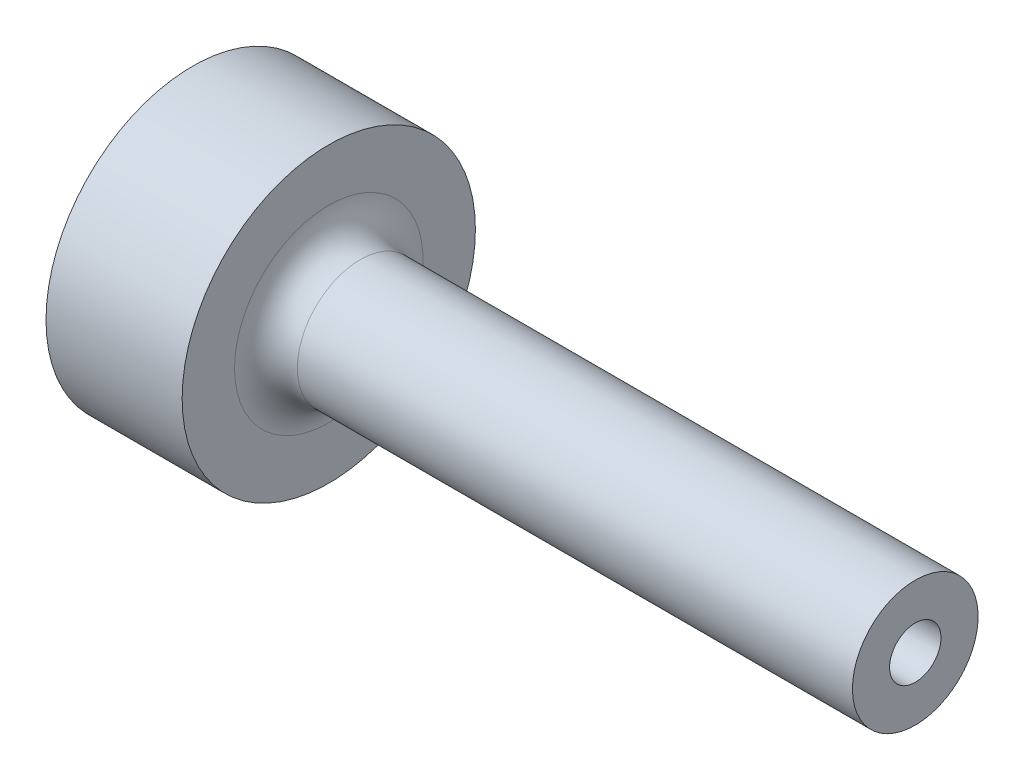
ISO-10303-21;
HEADER;
FILE_DESCRIPTION(('STEP AP214'),'2;1');
FILE_NAME('part.step','',(''),(''),'','','');
FILE_SCHEMA(('AUTOMOTIVE_DESIGN { 1 0 10303 214 1 1 1 1 }'));
ENDSEC;
DATA;
#1=APPLICATION_CONTEXT('core data for automotive mechanical design processes');
#2=APPLICATION_PROTOCOL_DEFINITION('international standard','automotive_design',2000,#1);
#3=PRODUCT_CONTEXT('',#1,'mechanical');
#4=PRODUCT('Part','Part','',(#3));
#5=PRODUCT_RELATED_PRODUCT_CATEGORY('part','',(#4));
#6=PRODUCT_DEFINITION_FORMATION('','',#4);
#7=PRODUCT_DEFINITION_CONTEXT('part definition',#1,'design');
#8=PRODUCT_DEFINITION('design','',#6,#7);
#9=PRODUCT_DEFINITION_SHAPE('','',#8);
#10=(LENGTH_UNIT() NAMED_UNIT(*) SI_UNIT(.MILLI.,.METRE.));
#11=(NAMED_UNIT(*) PLANE_ANGLE_UNIT() SI_UNIT($,.RADIAN.));
#12=(NAMED_UNIT(*) SI_UNIT($,.STERADIAN.) SOLID_ANGLE_UNIT());
#13=UNCERTAINTY_MEASURE_WITH_UNIT(LENGTH_MEASURE(1.E-05),#10,'distance_accuracy_value','');
#14=(GEOMETRIC_REPRESENTATION_CONTEXT(3) GLOBAL_UNCERTAINTY_ASSIGNED_CONTEXT((#13)) GLOBAL_UNIT_ASSIGNED_CONTEXT((#10,
#11,#12)) REPRESENTATION_CONTEXT('',''));
#15=CARTESIAN_POINT('',(0.,0.,0.));
#16=DIRECTION('',(0.,0.,1.));
#17=DIRECTION('',(1.,0.,0.));
#18=AXIS2_PLACEMENT_3D('',#15,#16,#17);
#19=CARTESIAN_POINT('',(0.,0.,0.));
#20=DIRECTION('',(-1.,0.,0.));
#21=DIRECTION('',(0.,0.,1.));
#22=AXIS2_PLACEMENT_3D('',#19,#20,#21);
#23=CYLINDRICAL_SURFACE('',#22,14.);
#24=CARTESIAN_POINT('',(13.,0.,0.));
#25=DIRECTION('',(-1.,0.,0.));
#26=DIRECTION('',(0.,0.,1.));
#27=AXIS2_PLACEMENT_3D('',#24,#25,#26);
#28=CIRCLE('',#27,14.);
#29=CARTESIAN_POINT('',(13.,0.,14.));
#30=VERTEX_POINT('',#29);
#31=EDGE_CURVE('E89',#30,#30,#28,.T.);
#32=ORIENTED_EDGE('',*,*,#31,.T.);
#33=EDGE_LOOP('',(#32));
#34=FACE_BOUND('',#33,.T.);
#35=CARTESIAN_POINT('',(0.,0.,0.));
#36=DIRECTION('',(-1.,0.,0.));
#37=DIRECTION('',(0.,0.,1.));
#38=AXIS2_PLACEMENT_3D('',#35,#36,#37);
#39=CIRCLE('',#38,14.);
#40=CARTESIAN_POINT('',(0.,0.,14.));
#41=VERTEX_POINT('',#40);
#42=EDGE_CURVE('E84',#41,#41,#39,.T.);
#43=ORIENTED_EDGE('',*,*,#42,.F.);
#44=EDGE_LOOP('',(#43));
#45=FACE_BOUND('',#44,.T.);
#46=CARTESIAN_POINT('',(6.5,-13.856406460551,-2.));
#47=CARTESIAN_POINT('',(6.61172417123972,-13.8564082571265,-1.99999534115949));
#48=CARTESIAN_POINT('',(6.72351471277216,-13.8577723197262,-1.99060664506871));
#49=CARTESIAN_POINT('',(6.9439746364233,-13.8630779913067,-1.95330740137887));
#50=CARTESIAN_POINT('',(7.05264079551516,-13.8670221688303,-1.92537839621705));
#51=CARTESIAN_POINT('',(7.26362870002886,-13.8770324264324,-1.85184738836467));
#52=CARTESIAN_POINT('',(7.36595507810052,-13.8830969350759,-1.80625847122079));
#53=CARTESIAN_POINT('',(7.56148972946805,-13.8966626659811,-1.69873175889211));
#54=CARTESIAN_POINT('',(7.65469934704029,-13.9041636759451,-1.63679637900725));
#55=CARTESIAN_POINT('',(7.83004829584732,-13.9198182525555,-1.49785346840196));
#56=CARTESIAN_POINT('',(7.91211171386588,-13.9279757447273,-1.42075056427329));
#57=CARTESIAN_POINT('',(8.06218155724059,-13.9439890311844,-1.25386707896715));
#58=CARTESIAN_POINT('',(8.13018723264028,-13.9518448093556,-1.16408582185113));
#59=CARTESIAN_POINT('',(8.25048909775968,-13.9664103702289,-0.973910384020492));
#60=CARTESIAN_POINT('',(8.30271571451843,-13.9731150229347,-0.873471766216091));
#61=CARTESIAN_POINT('',(8.38953073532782,-13.9845795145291,-0.665136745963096));
#62=CARTESIAN_POINT('',(8.4241199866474,-13.9893394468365,-0.557240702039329));
#63=CARTESIAN_POINT('',(8.47444920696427,-13.9963505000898,-0.337834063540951));
#64=CARTESIAN_POINT('',(8.49031606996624,-13.9986185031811,-0.226353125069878));
#65=CARTESIAN_POINT('',(8.5031438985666,-14.0004479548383,-0.00228956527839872));
#66=CARTESIAN_POINT('',(8.50010582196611,-14.0000095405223,0.110292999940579));
#67=CARTESIAN_POINT('',(8.47531062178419,-13.9964890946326,0.33249899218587));
#68=CARTESIAN_POINT('',(8.45369000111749,-13.9934263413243,0.442137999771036));
#69=CARTESIAN_POINT('',(8.39255744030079,-13.9850228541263,0.656215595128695));
#70=CARTESIAN_POINT('',(8.3530450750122,-13.9796820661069,0.760654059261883));
#71=CARTESIAN_POINT('',(8.25710925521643,-13.9672894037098,0.961781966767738));
#72=CARTESIAN_POINT('',(8.20062784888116,-13.9602316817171,1.05844339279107));
#73=CARTESIAN_POINT('',(8.07239950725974,-13.9451926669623,1.24096782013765));
#74=CARTESIAN_POINT('',(8.00065165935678,-13.9372113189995,1.32683017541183));
#75=CARTESIAN_POINT('',(7.843165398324,-13.921132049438,1.48612299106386));
#76=CARTESIAN_POINT('',(7.75730786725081,-13.9130337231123,1.55943569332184));
#77=CARTESIAN_POINT('',(7.57444547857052,-13.8977029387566,1.69062989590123));
#78=CARTESIAN_POINT('',(7.47744056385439,-13.890470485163,1.74851131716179));
#79=CARTESIAN_POINT('',(7.27491971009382,-13.8776905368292,1.84721301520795));
#80=CARTESIAN_POINT('',(7.1693981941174,-13.8721441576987,1.88802200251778));
#81=CARTESIAN_POINT('',(6.95290242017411,-13.8633846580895,1.9513062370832));
#82=CARTESIAN_POINT('',(6.84192850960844,-13.8601713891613,1.97378265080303));
#83=CARTESIAN_POINT('',(6.61872346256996,-13.8564698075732,1.99960390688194));
#84=CARTESIAN_POINT('',(6.50651197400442,-13.8559577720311,2.00311531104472));
#85=CARTESIAN_POINT('',(6.28310219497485,-13.8576537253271,1.9913480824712));
#86=CARTESIAN_POINT('',(6.17190387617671,-13.8598616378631,1.9760699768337));
#87=CARTESIAN_POINT('',(5.95418781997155,-13.8667269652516,1.92729837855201));
#88=CARTESIAN_POINT('',(5.84765127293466,-13.8713733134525,1.8938871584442));
#89=CARTESIAN_POINT('',(5.6416912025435,-13.8825829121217,1.80988306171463));
#90=CARTESIAN_POINT('',(5.54226800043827,-13.8891462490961,1.75928940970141));
#91=CARTESIAN_POINT('',(5.35260812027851,-13.9035064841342,1.64195360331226));
#92=CARTESIAN_POINT('',(5.26243903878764,-13.911311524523,1.57510320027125));
#93=CARTESIAN_POINT('',(5.09454027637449,-13.9272509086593,1.42730277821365));
#94=CARTESIAN_POINT('',(5.01681123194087,-13.9353852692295,1.34635203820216));
#95=CARTESIAN_POINT('',(4.8754047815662,-13.9511405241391,1.17191708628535));
#96=CARTESIAN_POINT('',(4.81183747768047,-13.9587570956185,1.07834317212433));
#97=CARTESIAN_POINT('',(4.70132443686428,-13.972552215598,0.881748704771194));
#98=CARTESIAN_POINT('',(4.65437828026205,-13.9787308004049,0.778728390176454));
#99=CARTESIAN_POINT('',(4.57861788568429,-13.9889347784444,0.566515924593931));
#100=CARTESIAN_POINT('',(4.54974241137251,-13.9929674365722,0.457345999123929));
#101=CARTESIAN_POINT('',(4.51074453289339,-13.9984555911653,0.235645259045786));
#102=CARTESIAN_POINT('',(4.50062101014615,-13.9999112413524,0.123114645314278));
#103=CARTESIAN_POINT('',(4.49943976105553,-14.0000800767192,-0.101043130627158));
#104=CARTESIAN_POINT('',(4.50821318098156,-13.998817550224,-0.212669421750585));
#105=CARTESIAN_POINT('',(4.54421615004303,-13.9937406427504,-0.432842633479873));
#106=CARTESIAN_POINT('',(4.57144565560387,-13.989926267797,-0.541389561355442));
#107=CARTESIAN_POINT('',(4.6435299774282,-13.9801722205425,-0.752283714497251));
#108=CARTESIAN_POINT('',(4.68837418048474,-13.9742338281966,-0.854634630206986));
#109=CARTESIAN_POINT('',(4.79439714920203,-13.960885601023,-1.05038570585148));
#110=CARTESIAN_POINT('',(4.8555763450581,-13.9534757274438,-1.14378562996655));
#111=CARTESIAN_POINT('',(4.99314771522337,-13.9379304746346,-1.31984194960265));
#112=CARTESIAN_POINT('',(5.06966490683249,-13.9297894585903,-1.40240016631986));
#113=CARTESIAN_POINT('',(5.2354775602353,-13.9137422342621,-1.55356716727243));
#114=CARTESIAN_POINT('',(5.32477602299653,-13.9058360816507,-1.6221726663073));
#115=CARTESIAN_POINT('',(5.51414543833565,-13.8911108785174,-1.74379523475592));
#116=CARTESIAN_POINT('',(5.61426869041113,-13.8842975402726,-1.79673154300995));
#117=CARTESIAN_POINT('',(5.82203229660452,-13.8725962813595,-1.88495902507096));
#118=CARTESIAN_POINT('',(5.92966459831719,-13.8677063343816,-1.92026877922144));
#119=CARTESIAN_POINT('',(6.11483642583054,-13.8615529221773,-1.96409255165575));
#120=CARTESIAN_POINT('',(6.19122433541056,-13.859633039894,-1.97753762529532));
#121=CARTESIAN_POINT('',(6.34506419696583,-13.857059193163,-1.99549291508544));
#122=CARTESIAN_POINT('',(6.42251613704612,-13.8564052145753,-2.00000323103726));
#123=CARTESIAN_POINT('',(6.5,-13.856406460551,-2.));
#124=B_SPLINE_CURVE_WITH_KNOTS('',3,(#46,#47,#48,#49,#50,#51,#52,#53,#54,#55,#56,#57,#58,#59,
#60,#61,#62,#63,#64,#65,#66,#67,#68,#69,#70,#71,#72,#73,#74,#75,#76,#77,#78,#79,#80,#81,#82,#83,
#84,#85,#86,#87,#88,#89,#90,#91,#92,#93,#94,#95,#96,#97,#98,#99,#100,#101,#102,#103,#104,#105,
#106,#107,#108,#109,#110,#111,#112,#113,#114,#115,#116,#117,#118,#119,#120,#121,#122,#123),
.UNSPECIFIED.,.T.,.F.,(4,2,2,2,2,2,2,2,2,2,2,2,2,2,2,2,2,2,2,2,2,2,2,2,2,2,2,2,2,2,2,2,2,2,2,2,
2,2,4),(0.,0.334889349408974,0.670112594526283,1.00508792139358,1.34001378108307,
1.6771171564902,2.01423851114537,2.35282530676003,2.6913958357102,3.02765822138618,
3.36390357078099,3.69769984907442,4.03150405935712,4.36646147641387,4.70143892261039,
5.03940517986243,5.37737316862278,5.7155642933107,6.05373389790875,6.3889286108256,
6.72411392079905,7.05779100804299,7.39148315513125,7.72746121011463,8.06345644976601,
8.40197921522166,8.74049343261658,9.07785422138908,9.41519488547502,9.74953375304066,
10.083871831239,10.4180087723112,10.7521545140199,11.0891434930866,11.426211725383,
11.7649881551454,12.103406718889,12.3356645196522,12.5679197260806),.UNSPECIFIED.);
#125=CARTESIAN_POINT('',(6.5,-13.856406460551,-2.));
#126=VERTEX_POINT('',#125);
#127=EDGE_CURVE('E10',#126,#126,#124,.T.);
#128=ORIENTED_EDGE('',*,*,#127,.F.);
#129=EDGE_LOOP('',(#128));
#130=FACE_BOUND('',#129,.T.);
#131=ADVANCED_FACE('F16',(#34,#45,#130),#23,.T.);
#132=CARTESIAN_POINT('',(0.,0.,0.));
#133=DIRECTION('',(1.,0.,0.));
#134=DIRECTION('',(0.,0.,-1.));
#135=AXIS2_PLACEMENT_3D('',#132,#133,#134);
#136=CONICAL_SURFACE('',#135,1.25,0.0174532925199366);
#137=CARTESIAN_POINT('',(69.,0.,0.));
#138=DIRECTION('',(-1.,0.,0.));
#139=DIRECTION('',(0.,0.,1.));
#140=AXIS2_PLACEMENT_3D('',#137,#138,#139);
#141=CIRCLE('',#140,2.45439948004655);
#142=CARTESIAN_POINT('',(69.,0.,2.45439948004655));
#143=VERTEX_POINT('',#142);
#144=EDGE_CURVE('E81',#143,#143,#141,.T.);
#145=ORIENTED_EDGE('',*,*,#144,.F.);
#146=EDGE_LOOP('',(#145));
#147=FACE_BOUND('',#146,.T.);
#148=CARTESIAN_POINT('',(0.924407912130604,0.,0.));
#149=DIRECTION('',(-1.,0.,0.));
#150=DIRECTION('',(0.,0.,1.));
#151=AXIS2_PLACEMENT_3D('',#148,#149,#150);
#152=CIRCLE('',#151,1.26613560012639);
#153=CARTESIAN_POINT('',(0.924407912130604,0.,1.26613560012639));
#154=VERTEX_POINT('',#153);
#155=EDGE_CURVE('E94',#154,#154,#152,.F.);
#156=ORIENTED_EDGE('',*,*,#155,.F.);
#157=EDGE_LOOP('',(#156));
#158=FACE_BOUND('',#157,.T.);
#159=ADVANCED_FACE('F45',(#147,#158),#136,.F.);
#160=CARTESIAN_POINT('',(16.,0.,0.));
#161=DIRECTION('',(-1.,0.,0.));
#162=DIRECTION('',(0.,0.,1.));
#163=AXIS2_PLACEMENT_3D('',#160,#161,#162);
#164=TOROIDAL_SURFACE('',#163,9.,3.);
#165=CARTESIAN_POINT('',(13.,0.,0.));
#166=DIRECTION('',(-1.,0.,0.));
#167=DIRECTION('',(0.,0.,1.));
#168=AXIS2_PLACEMENT_3D('',#165,#166,#167);
#169=CIRCLE('',#168,9.);
#170=CARTESIAN_POINT('',(13.,0.,9.));
#171=VERTEX_POINT('',#170);
#172=EDGE_CURVE('E91',#171,#171,#169,.T.);
#173=ORIENTED_EDGE('',*,*,#172,.F.);
#174=EDGE_LOOP('',(#173));
#175=FACE_BOUND('',#174,.T.);
#176=CARTESIAN_POINT('',(16.,0.,0.));
#177=DIRECTION('',(-1.,0.,0.));
#178=DIRECTION('',(0.,0.,1.));
#179=AXIS2_PLACEMENT_3D('',#176,#177,#178);
#180=CIRCLE('',#179,6.);
#181=CARTESIAN_POINT('',(16.,0.,6.));
#182=VERTEX_POINT('',#181);
#183=EDGE_CURVE('E28',#182,#182,#180,.T.);
#184=ORIENTED_EDGE('',*,*,#183,.T.);
#185=EDGE_LOOP('',(#184));
#186=FACE_BOUND('',#185,.T.);
#187=ADVANCED_FACE('F18',(#175,#186),#164,.F.);
#188=CARTESIAN_POINT('',(0.,0.,0.));
#189=DIRECTION('',(-1.,0.,0.));
#190=DIRECTION('',(0.,0.,1.));
#191=AXIS2_PLACEMENT_3D('',#188,#189,#190);
#192=CYLINDRICAL_SURFACE('',#191,6.);
#193=ORIENTED_EDGE('',*,*,#183,.F.);
#194=EDGE_LOOP('',(#193));
#195=FACE_BOUND('',#194,.T.);
#196=CARTESIAN_POINT('',(69.,0.,0.));
#197=DIRECTION('',(-1.,0.,0.));
#198=DIRECTION('',(0.,0.,1.));
#199=AXIS2_PLACEMENT_3D('',#196,#197,#198);
#200=CIRCLE('',#199,6.);
#201=CARTESIAN_POINT('',(69.,0.,6.));
#202=VERTEX_POINT('',#201);
#203=EDGE_CURVE('E80',#202,#202,#200,.T.);
#204=ORIENTED_EDGE('',*,*,#203,.T.);
#205=EDGE_LOOP('',(#204));
#206=FACE_BOUND('',#205,.T.);
#207=ADVANCED_FACE('F66',(#195,#206),#192,.T.);
#208=CARTESIAN_POINT('',(69.,6.,0.));
#209=DIRECTION('',(-1.,0.,0.));
#210=DIRECTION('',(0.,0.,1.));
#211=AXIS2_PLACEMENT_3D('',#208,#209,#210);
#212=PLANE('',#211);
#213=ORIENTED_EDGE('',*,*,#203,.F.);
#214=EDGE_LOOP('',(#213));
#215=FACE_BOUND('',#214,.T.);
#216=ORIENTED_EDGE('',*,*,#144,.T.);
#217=EDGE_LOOP('',(#216));
#218=FACE_BOUND('',#217,.T.);
#219=ADVANCED_FACE('F62',(#215,#218),#212,.F.);
#220=CARTESIAN_POINT('',(0.,1.25,0.));
#221=DIRECTION('',(1.,0.,0.));
#222=DIRECTION('',(0.,0.,-1.));
#223=AXIS2_PLACEMENT_3D('',#220,#221,#222);
#224=PLANE('',#223);
#225=CARTESIAN_POINT('',(0.,0.,0.));
#226=DIRECTION('',(-1.,0.,0.));
#227=DIRECTION('',(0.,0.,1.));
#228=AXIS2_PLACEMENT_3D('',#225,#226,#227);
#229=CIRCLE('',#228,5.);
#230=CARTESIAN_POINT('',(0.,0.,5.));
#231=VERTEX_POINT('',#230);
#232=EDGE_CURVE('E97',#231,#231,#229,.T.);
#233=ORIENTED_EDGE('',*,*,#232,.F.);
#234=EDGE_LOOP('',(#233));
#235=FACE_BOUND('',#234,.T.);
#236=ORIENTED_EDGE('',*,*,#42,.T.);
#237=EDGE_LOOP('',(#236));
#238=FACE_BOUND('',#237,.T.);
#239=ADVANCED_FACE('F60',(#235,#238),#224,.F.);
#240=CARTESIAN_POINT('',(13.,14.,0.));
#241=DIRECTION('',(-1.,0.,0.));
#242=DIRECTION('',(0.,0.,1.));
#243=AXIS2_PLACEMENT_3D('',#240,#241,#242);
#244=PLANE('',#243);
#245=ORIENTED_EDGE('',*,*,#31,.F.);
#246=EDGE_LOOP('',(#245));
#247=FACE_BOUND('',#246,.T.);
#248=ORIENTED_EDGE('',*,*,#172,.T.);
#249=EDGE_LOOP('',(#248));
#250=FACE_BOUND('',#249,.T.);
#251=ADVANCED_FACE('F58',(#247,#250),#244,.F.);
#252=CARTESIAN_POINT('',(-14.4672767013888,0.,0.));
#253=DIRECTION('',(-1.,0.,0.));
#254=DIRECTION('',(0.,0.,1.));
#255=AXIS2_PLACEMENT_3D('',#252,#253,#254);
#256=DEGENERATE_TOROIDAL_SURFACE('',#255,0.56308411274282,15.5,.F.);
#257=ORIENTED_EDGE('',*,*,#232,.T.);
#258=EDGE_LOOP('',(#257));
#259=FACE_BOUND('',#258,.T.);
#260=ORIENTED_EDGE('',*,*,#155,.T.);
#261=EDGE_LOOP('',(#260));
#262=FACE_BOUND('',#261,.T.);
#263=ADVANCED_FACE('F41',(#259,#262),#256,.T.);
#264=CARTESIAN_POINT('',(6.5,-14.,0.));
#265=DIRECTION('',(0.,-1.,0.));
#266=DIRECTION('',(0.,0.,-1.));
#267=AXIS2_PLACEMENT_3D('',#264,#265,#266);
#268=CYLINDRICAL_SURFACE('',#267,2.);
#269=CARTESIAN_POINT('',(6.5,-8.,0.));
#270=DIRECTION('',(0.,-1.,0.));
#271=DIRECTION('',(0.,0.,-1.));
#272=AXIS2_PLACEMENT_3D('',#269,#270,#271);
#273=CIRCLE('',#272,2.);
#274=CARTESIAN_POINT('',(6.5,-8.,-2.));
#275=VERTEX_POINT('',#274);
#276=EDGE_CURVE('E100',#275,#275,#273,.T.);
#277=ORIENTED_EDGE('',*,*,#276,.F.);
#278=EDGE_LOOP('',(#277));
#279=FACE_BOUND('',#278,.T.);
#280=ORIENTED_EDGE('',*,*,#127,.T.);
#281=EDGE_LOOP('',(#280));
#282=FACE_BOUND('',#281,.T.);
#283=ADVANCED_FACE('F33',(#279,#282),#268,.F.);
#284=CARTESIAN_POINT('',(6.5,-6.84529946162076,0.));
#285=DIRECTION('',(0.,-1.,0.));
#286=DIRECTION('',(0.,0.,-1.));
#287=AXIS2_PLACEMENT_3D('',#284,#285,#286);
#288=CONICAL_SURFACE('',#287,0.,1.0471975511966);
#289=ORIENTED_EDGE('',*,*,#276,.T.);
#290=EDGE_LOOP('',(#289));
#291=FACE_BOUND('',#290,.T.);
#292=CARTESIAN_POINT('',(6.5,-6.84529946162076,0.));
#293=VERTEX_POINT('',#292);
#294=VERTEX_LOOP('',#293);
#295=FACE_BOUND('',#294,.T.);
#296=ADVANCED_FACE('F31',(#291,#295),#288,.F.);
#297=CLOSED_SHELL('',(#131,#159,#187,#207,#219,#239,#251,#263,#283,#296));
#298=MANIFOLD_SOLID_BREP('B1',#297);
#299=ADVANCED_BREP_SHAPE_REPRESENTATION('',(#18,#298),#14);
#300=SHAPE_DEFINITION_REPRESENTATION(#9,#299);
ENDSEC;
END-ISO-10303-21;
